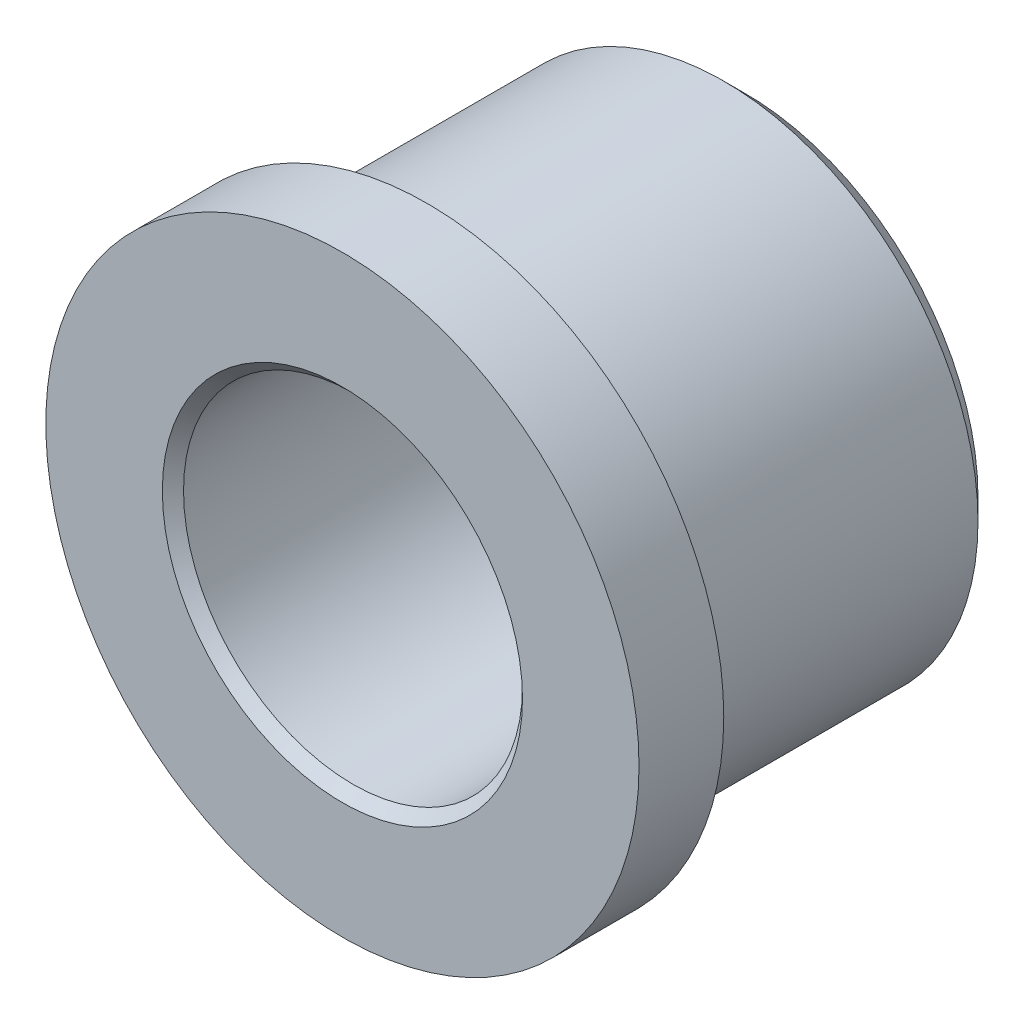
ISO-10303-21;
HEADER;
FILE_DESCRIPTION(('STEP AP214'),'2;1');
FILE_NAME('part.step','',(''),(''),'','','');
FILE_SCHEMA(('AUTOMOTIVE_DESIGN { 1 0 10303 214 1 1 1 1 }'));
ENDSEC;
DATA;
#1=APPLICATION_CONTEXT('core data for automotive mechanical design processes');
#2=APPLICATION_PROTOCOL_DEFINITION('international standard','automotive_design',2000,#1);
#3=PRODUCT_CONTEXT('',#1,'mechanical');
#4=PRODUCT('Part','Part','',(#3));
#5=PRODUCT_RELATED_PRODUCT_CATEGORY('part','',(#4));
#6=PRODUCT_DEFINITION_FORMATION('','',#4);
#7=PRODUCT_DEFINITION_CONTEXT('part definition',#1,'design');
#8=PRODUCT_DEFINITION('design','',#6,#7);
#9=PRODUCT_DEFINITION_SHAPE('','',#8);
#10=(LENGTH_UNIT() NAMED_UNIT(*) SI_UNIT(.MILLI.,.METRE.));
#11=(NAMED_UNIT(*) PLANE_ANGLE_UNIT() SI_UNIT($,.RADIAN.));
#12=(NAMED_UNIT(*) SI_UNIT($,.STERADIAN.) SOLID_ANGLE_UNIT());
#13=UNCERTAINTY_MEASURE_WITH_UNIT(LENGTH_MEASURE(1.E-05),#10,'distance_accuracy_value','');
#14=(GEOMETRIC_REPRESENTATION_CONTEXT(3) GLOBAL_UNCERTAINTY_ASSIGNED_CONTEXT((#13)) GLOBAL_UNIT_ASSIGNED_CONTEXT((#10,
#11,#12)) REPRESENTATION_CONTEXT('',''));
#15=CARTESIAN_POINT('',(0.,0.,0.));
#16=DIRECTION('',(0.,0.,1.));
#17=DIRECTION('',(1.,0.,0.));
#18=AXIS2_PLACEMENT_3D('',#15,#16,#17);
#19=CARTESIAN_POINT('',(0.,24.7771123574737,2.));
#20=DIRECTION('',(0.,0.,1.));
#21=DIRECTION('',(1.,0.,0.));
#22=AXIS2_PLACEMENT_3D('',#19,#20,#21);
#23=PLANE('',#22);
#24=CARTESIAN_POINT('',(0.,24.7771123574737,2.));
#25=DIRECTION('',(0.,0.,1.));
#26=DIRECTION('',(1.,0.,0.));
#27=AXIS2_PLACEMENT_3D('',#24,#25,#26);
#28=CIRCLE('',#27,4.25);
#29=CARTESIAN_POINT('',(4.25,24.7771123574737,2.));
#30=VERTEX_POINT('',#29);
#31=EDGE_CURVE('E47',#30,#30,#28,.F.);
#32=ORIENTED_EDGE('',*,*,#31,.T.);
#33=EDGE_LOOP('',(#32));
#34=FACE_BOUND('',#33,.T.);
#35=CARTESIAN_POINT('',(0.,24.7771123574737,2.));
#36=DIRECTION('',(0.,0.,1.));
#37=DIRECTION('',(1.,0.,0.));
#38=AXIS2_PLACEMENT_3D('',#35,#36,#37);
#39=CIRCLE('',#38,7.);
#40=CARTESIAN_POINT('',(6.99999999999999,24.7771123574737,2.));
#41=VERTEX_POINT('',#40);
#42=EDGE_CURVE('E53',#41,#41,#39,.T.);
#43=ORIENTED_EDGE('',*,*,#42,.T.);
#44=EDGE_LOOP('',(#43));
#45=FACE_BOUND('',#44,.T.);
#46=ADVANCED_FACE('F27',(#34,#45),#23,.T.);
#47=CARTESIAN_POINT('',(0.,24.7771123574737,0.));
#48=DIRECTION('',(0.,0.,1.));
#49=DIRECTION('',(1.,0.,0.));
#50=AXIS2_PLACEMENT_3D('',#47,#48,#49);
#51=PLANE('',#50);
#52=CARTESIAN_POINT('',(0.,24.7771123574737,0.));
#53=DIRECTION('',(0.,0.,1.));
#54=DIRECTION('',(1.,0.,0.));
#55=AXIS2_PLACEMENT_3D('',#52,#53,#54);
#56=CIRCLE('',#55,7.);
#57=CARTESIAN_POINT('',(6.99999999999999,24.7771123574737,0.));
#58=VERTEX_POINT('',#57);
#59=EDGE_CURVE('E56',#58,#58,#56,.T.);
#60=ORIENTED_EDGE('',*,*,#59,.F.);
#61=EDGE_LOOP('',(#60));
#62=FACE_BOUND('',#61,.T.);
#63=CARTESIAN_POINT('',(0.,24.7771123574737,0.));
#64=DIRECTION('',(0.,0.,1.));
#65=DIRECTION('',(1.,0.,0.));
#66=AXIS2_PLACEMENT_3D('',#63,#64,#65);
#67=CIRCLE('',#66,6.);
#68=CARTESIAN_POINT('',(6.,24.7771123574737,0.));
#69=VERTEX_POINT('',#68);
#70=EDGE_CURVE('E59',#69,#69,#67,.T.);
#71=ORIENTED_EDGE('',*,*,#70,.T.);
#72=EDGE_LOOP('',(#71));
#73=FACE_BOUND('',#72,.T.);
#74=ADVANCED_FACE('F63',(#62,#73),#51,.F.);
#75=CARTESIAN_POINT('',(0.,24.7771123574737,2.));
#76=DIRECTION('',(0.,0.,-1.));
#77=DIRECTION('',(-1.,0.,0.));
#78=AXIS2_PLACEMENT_3D('',#75,#76,#77);
#79=CYLINDRICAL_SURFACE('',#78,7.);
#80=ORIENTED_EDGE('',*,*,#42,.F.);
#81=EDGE_LOOP('',(#80));
#82=FACE_BOUND('',#81,.T.);
#83=ORIENTED_EDGE('',*,*,#59,.T.);
#84=EDGE_LOOP('',(#83));
#85=FACE_BOUND('',#84,.T.);
#86=ADVANCED_FACE('F29',(#82,#85),#79,.T.);
#87=CARTESIAN_POINT('',(0.,24.7771123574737,-7.5));
#88=DIRECTION('',(0.,0.,1.));
#89=DIRECTION('',(1.,0.,0.));
#90=AXIS2_PLACEMENT_3D('',#87,#88,#89);
#91=CYLINDRICAL_SURFACE('',#90,6.);
#92=CARTESIAN_POINT('',(0.,24.7771123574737,-7.));
#93=DIRECTION('',(0.,0.,1.));
#94=DIRECTION('',(1.,0.,0.));
#95=AXIS2_PLACEMENT_3D('',#92,#93,#94);
#96=CIRCLE('',#95,6.);
#97=CARTESIAN_POINT('',(6.,24.7771123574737,-7.));
#98=VERTEX_POINT('',#97);
#99=EDGE_CURVE('E10',#98,#98,#96,.T.);
#100=ORIENTED_EDGE('',*,*,#99,.T.);
#101=EDGE_LOOP('',(#100));
#102=FACE_BOUND('',#101,.T.);
#103=ORIENTED_EDGE('',*,*,#70,.F.);
#104=EDGE_LOOP('',(#103));
#105=FACE_BOUND('',#104,.T.);
#106=ADVANCED_FACE('F65',(#102,#105),#91,.T.);
#107=CARTESIAN_POINT('',(0.,24.7771123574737,-7.5));
#108=DIRECTION('',(0.,0.,1.));
#109=DIRECTION('',(1.,0.,0.));
#110=AXIS2_PLACEMENT_3D('',#107,#108,#109);
#111=PLANE('',#110);
#112=CARTESIAN_POINT('',(0.,24.7771123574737,-7.5));
#113=DIRECTION('',(0.,0.,1.));
#114=DIRECTION('',(1.,0.,0.));
#115=AXIS2_PLACEMENT_3D('',#112,#113,#114);
#116=CIRCLE('',#115,4.5);
#117=CARTESIAN_POINT('',(4.5,24.7771123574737,-7.5));
#118=VERTEX_POINT('',#117);
#119=EDGE_CURVE('E38',#118,#118,#116,.T.);
#120=ORIENTED_EDGE('',*,*,#119,.T.);
#121=EDGE_LOOP('',(#120));
#122=FACE_BOUND('',#121,.T.);
#123=CARTESIAN_POINT('',(0.,24.7771123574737,-7.5));
#124=DIRECTION('',(0.,0.,1.));
#125=DIRECTION('',(1.,0.,0.));
#126=AXIS2_PLACEMENT_3D('',#123,#124,#125);
#127=CIRCLE('',#126,5.5);
#128=CARTESIAN_POINT('',(5.49999999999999,24.7771123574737,-7.5));
#129=VERTEX_POINT('',#128);
#130=EDGE_CURVE('E42',#129,#129,#127,.F.);
#131=ORIENTED_EDGE('',*,*,#130,.T.);
#132=EDGE_LOOP('',(#131));
#133=FACE_BOUND('',#132,.T.);
#134=ADVANCED_FACE('F67',(#122,#133),#111,.F.);
#135=CARTESIAN_POINT('',(0.,24.7771123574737,-7.5));
#136=DIRECTION('',(0.,0.,1.));
#137=DIRECTION('',(1.,0.,0.));
#138=AXIS2_PLACEMENT_3D('',#135,#136,#137);
#139=CYLINDRICAL_SURFACE('',#138,4.);
#140=CARTESIAN_POINT('',(0.,24.7771123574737,-7.));
#141=DIRECTION('',(0.,0.,1.));
#142=DIRECTION('',(1.,0.,0.));
#143=AXIS2_PLACEMENT_3D('',#140,#141,#142);
#144=CIRCLE('',#143,4.);
#145=CARTESIAN_POINT('',(4.,24.7771123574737,-7.));
#146=VERTEX_POINT('',#145);
#147=EDGE_CURVE('E34',#146,#146,#144,.F.);
#148=ORIENTED_EDGE('',*,*,#147,.T.);
#149=EDGE_LOOP('',(#148));
#150=FACE_BOUND('',#149,.T.);
#151=CARTESIAN_POINT('',(0.,24.7771123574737,1.75));
#152=DIRECTION('',(0.,0.,1.));
#153=DIRECTION('',(1.,0.,0.));
#154=AXIS2_PLACEMENT_3D('',#151,#152,#153);
#155=CIRCLE('',#154,4.);
#156=CARTESIAN_POINT('',(4.,24.7771123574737,1.75));
#157=VERTEX_POINT('',#156);
#158=EDGE_CURVE('E50',#157,#157,#155,.T.);
#159=ORIENTED_EDGE('',*,*,#158,.T.);
#160=EDGE_LOOP('',(#159));
#161=FACE_BOUND('',#160,.T.);
#162=ADVANCED_FACE('F73',(#150,#161),#139,.F.);
#163=CARTESIAN_POINT('',(0.,24.7771123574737,1.75));
#164=DIRECTION('',(0.,0.,1.));
#165=DIRECTION('',(1.,0.,0.));
#166=AXIS2_PLACEMENT_3D('',#163,#164,#165);
#167=CONICAL_SURFACE('',#166,4.,0.78539816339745);
#168=ORIENTED_EDGE('',*,*,#31,.F.);
#169=EDGE_LOOP('',(#168));
#170=FACE_BOUND('',#169,.T.);
#171=ORIENTED_EDGE('',*,*,#158,.F.);
#172=EDGE_LOOP('',(#171));
#173=FACE_BOUND('',#172,.T.);
#174=ADVANCED_FACE('F90',(#170,#173),#167,.F.);
#175=CARTESIAN_POINT('',(0.,24.7771123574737,-7.5));
#176=DIRECTION('',(0.,0.,-1.));
#177=DIRECTION('',(-1.,0.,0.));
#178=AXIS2_PLACEMENT_3D('',#175,#176,#177);
#179=CONICAL_SURFACE('',#178,4.5,0.785398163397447);
#180=ORIENTED_EDGE('',*,*,#147,.F.);
#181=EDGE_LOOP('',(#180));
#182=FACE_BOUND('',#181,.T.);
#183=ORIENTED_EDGE('',*,*,#119,.F.);
#184=EDGE_LOOP('',(#183));
#185=FACE_BOUND('',#184,.T.);
#186=ADVANCED_FACE('F93',(#182,#185),#179,.F.);
#187=CARTESIAN_POINT('',(0.,24.7771123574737,-7.));
#188=DIRECTION('',(0.,0.,1.));
#189=DIRECTION('',(1.,0.,0.));
#190=AXIS2_PLACEMENT_3D('',#187,#188,#189);
#191=CONICAL_SURFACE('',#190,6.,0.785398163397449);
#192=ORIENTED_EDGE('',*,*,#130,.F.);
#193=EDGE_LOOP('',(#192));
#194=FACE_BOUND('',#193,.T.);
#195=ORIENTED_EDGE('',*,*,#99,.F.);
#196=EDGE_LOOP('',(#195));
#197=FACE_BOUND('',#196,.T.);
#198=ADVANCED_FACE('F104',(#194,#197),#191,.T.);
#199=CLOSED_SHELL('',(#46,#74,#86,#106,#134,#162,#174,#186,#198));
#200=MANIFOLD_SOLID_BREP('B2',#199);
#201=ADVANCED_BREP_SHAPE_REPRESENTATION('',(#18,#200),#14);
#202=SHAPE_DEFINITION_REPRESENTATION(#9,#201);
ENDSEC;
END-ISO-10303-21;
